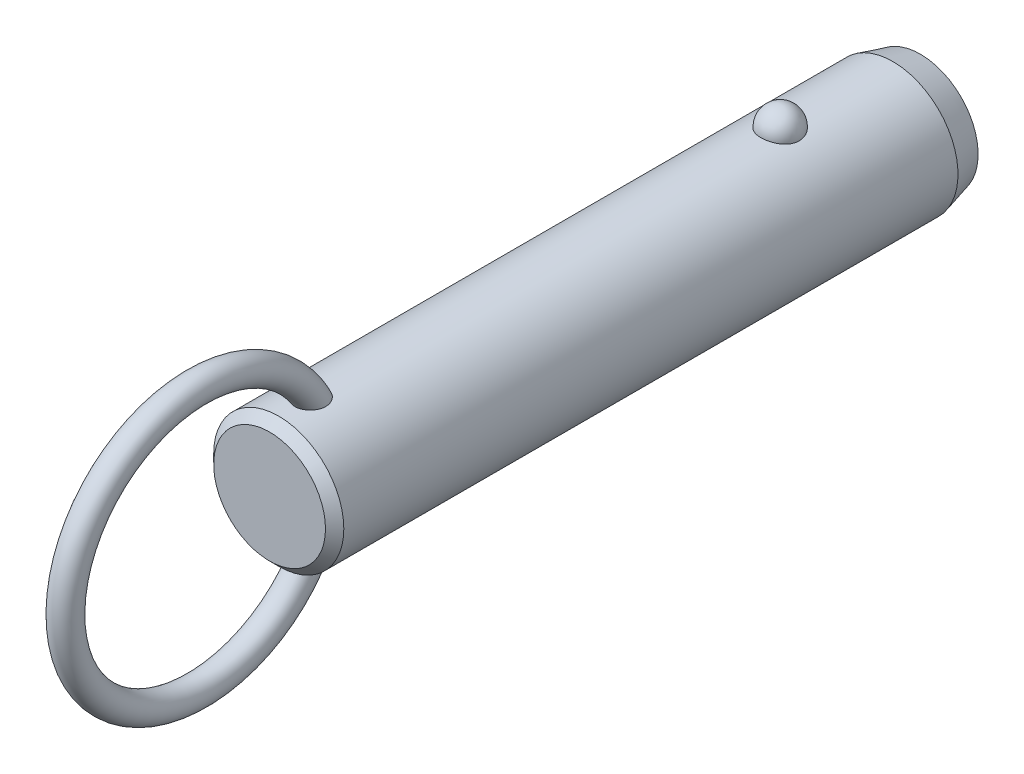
ISO-10303-21;
HEADER;
FILE_DESCRIPTION(('STEP AP214'),'2;1');
FILE_NAME('part.step','',(''),(''),'','','');
FILE_SCHEMA(('AUTOMOTIVE_DESIGN { 1 0 10303 214 1 1 1 1 }'));
ENDSEC;
DATA;
#1=APPLICATION_CONTEXT('core data for automotive mechanical design processes');
#2=APPLICATION_PROTOCOL_DEFINITION('international standard','automotive_design',2000,#1);
#3=PRODUCT_CONTEXT('',#1,'mechanical');
#4=PRODUCT('Part','Part','',(#3));
#5=PRODUCT_RELATED_PRODUCT_CATEGORY('part','',(#4));
#6=PRODUCT_DEFINITION_FORMATION('','',#4);
#7=PRODUCT_DEFINITION_CONTEXT('part definition',#1,'design');
#8=PRODUCT_DEFINITION('design','',#6,#7);
#9=PRODUCT_DEFINITION_SHAPE('','',#8);
#10=(LENGTH_UNIT() NAMED_UNIT(*) SI_UNIT(.MILLI.,.METRE.));
#11=(NAMED_UNIT(*) PLANE_ANGLE_UNIT() SI_UNIT($,.RADIAN.));
#12=(NAMED_UNIT(*) SI_UNIT($,.STERADIAN.) SOLID_ANGLE_UNIT());
#13=UNCERTAINTY_MEASURE_WITH_UNIT(LENGTH_MEASURE(1.E-05),#10,'distance_accuracy_value','');
#14=(GEOMETRIC_REPRESENTATION_CONTEXT(3) GLOBAL_UNCERTAINTY_ASSIGNED_CONTEXT((#13)) GLOBAL_UNIT_ASSIGNED_CONTEXT((#10,
#11,#12)) REPRESENTATION_CONTEXT('',''));
#15=CARTESIAN_POINT('',(0.,0.,0.));
#16=DIRECTION('',(0.,0.,1.));
#17=DIRECTION('',(1.,0.,0.));
#18=AXIS2_PLACEMENT_3D('',#15,#16,#17);
#19=CARTESIAN_POINT('',(0.,0.,45.7));
#20=DIRECTION('',(0.,0.,-1.));
#21=DIRECTION('',(-1.,0.,0.));
#22=AXIS2_PLACEMENT_3D('',#19,#20,#21);
#23=CYLINDRICAL_SURFACE('',#22,7.1);
#24=CARTESIAN_POINT('',(2.0769088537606,6.78943661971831,-2.1));
#25=CARTESIAN_POINT('',(2.07690739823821,6.78943796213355,-1.98268154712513));
#26=CARTESIAN_POINT('',(2.06738130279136,6.79237331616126,-1.86534506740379));
#27=CARTESIAN_POINT('',(2.0295040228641,6.8037853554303,-1.63400788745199));
#28=CARTESIAN_POINT('',(2.00114757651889,6.81226358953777,-1.52000812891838));
#29=CARTESIAN_POINT('',(1.92632025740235,6.83379798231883,-1.29863433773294));
#30=CARTESIAN_POINT('',(1.87985726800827,6.84685214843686,-1.19125744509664));
#31=CARTESIAN_POINT('',(1.76995205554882,6.87608091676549,-0.986046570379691));
#32=CARTESIAN_POINT('',(1.70650980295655,6.8922555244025,-0.888212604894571));
#33=CARTESIAN_POINT('',(1.56381192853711,6.92602930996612,-0.704242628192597));
#34=CARTESIAN_POINT('',(1.4844714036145,6.94363582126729,-0.618173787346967));
#35=CARTESIAN_POINT('',(1.31221746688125,6.97823658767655,-0.460740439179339));
#36=CARTESIAN_POINT('',(1.21930409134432,6.99523084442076,-0.389375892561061));
#37=CARTESIAN_POINT('',(1.02268781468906,7.02666176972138,-0.263547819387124));
#38=CARTESIAN_POINT('',(0.919020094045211,7.04110638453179,-0.209031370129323));
#39=CARTESIAN_POINT('',(0.703548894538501,7.06588726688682,-0.118163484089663));
#40=CARTESIAN_POINT('',(0.591746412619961,7.07622403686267,-0.081809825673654));
#41=CARTESIAN_POINT('',(0.365557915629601,7.09147068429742,-0.0288711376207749));
#42=CARTESIAN_POINT('',(0.251267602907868,7.09648447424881,-0.0119070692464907));
#43=CARTESIAN_POINT('',(0.0213499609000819,7.10089837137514,0.00304925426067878));
#44=CARTESIAN_POINT('',(-0.0942772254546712,7.10029907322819,0.00104351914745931));
#45=CARTESIAN_POINT('',(-0.321651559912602,7.09360829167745,-0.0216931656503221));
#46=CARTESIAN_POINT('',(-0.433431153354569,7.08760388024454,-0.0421272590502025));
#47=CARTESIAN_POINT('',(-0.651862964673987,7.07086131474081,-0.100729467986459));
#48=CARTESIAN_POINT('',(-0.758515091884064,7.06012307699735,-0.138897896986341));
#49=CARTESIAN_POINT('',(-0.96444924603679,7.03496097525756,-0.232213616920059));
#50=CARTESIAN_POINT('',(-1.06368095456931,7.02051445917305,-0.287465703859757));
#51=CARTESIAN_POINT('',(-1.25145353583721,6.98948740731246,-0.413383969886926));
#52=CARTESIAN_POINT('',(-1.33999321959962,6.97290663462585,-0.48405186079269));
#53=CARTESIAN_POINT('',(-1.50591604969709,6.93898770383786,-0.640594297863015));
#54=CARTESIAN_POINT('',(-1.58302488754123,6.92164094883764,-0.72675782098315));
#55=CARTESIAN_POINT('',(-1.72189320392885,6.8884103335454,-0.910927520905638));
#56=CARTESIAN_POINT('',(-1.78365144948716,6.87252659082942,-1.008934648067));
#57=CARTESIAN_POINT('',(-1.89101272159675,6.84377189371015,-1.21549497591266));
#58=CARTESIAN_POINT('',(-1.93639553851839,6.83094274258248,-1.32416860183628));
#59=CARTESIAN_POINT('',(-2.00874275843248,6.81002070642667,-1.54791500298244));
#60=CARTESIAN_POINT('',(-2.03570774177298,6.80192767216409,-1.66298757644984));
#61=CARTESIAN_POINT('',(-2.07047276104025,6.7914266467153,-1.89571453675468));
#62=CARTESIAN_POINT('',(-2.07835878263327,6.78899315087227,-2.01335491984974));
#63=CARTESIAN_POINT('',(-2.07502083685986,6.79001409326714,-2.24833570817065));
#64=CARTESIAN_POINT('',(-2.06379746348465,6.7934683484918,-2.36567612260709));
#65=CARTESIAN_POINT('',(-2.02263913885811,6.80583442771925,-2.59603194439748));
#66=CARTESIAN_POINT('',(-1.99281127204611,6.81471501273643,-2.70906820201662));
#67=CARTESIAN_POINT('',(-1.91526639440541,6.83691232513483,-2.92836575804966));
#68=CARTESIAN_POINT('',(-1.8675486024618,6.85022924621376,-3.03462676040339));
#69=CARTESIAN_POINT('',(-1.75504492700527,6.87991336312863,-3.23806487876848));
#70=CARTESIAN_POINT('',(-1.69015924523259,6.89629822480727,-3.33518422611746));
#71=CARTESIAN_POINT('',(-1.54505404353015,6.93024852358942,-3.51697105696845));
#72=CARTESIAN_POINT('',(-1.46483385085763,6.94781401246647,-3.60163799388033));
#73=CARTESIAN_POINT('',(-1.29071406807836,6.98225977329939,-3.75654119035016));
#74=CARTESIAN_POINT('',(-1.19675650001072,6.99913673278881,-3.82671308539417));
#75=CARTESIAN_POINT('',(-0.997940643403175,7.03023618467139,-3.9501837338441));
#76=CARTESIAN_POINT('',(-0.893083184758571,7.04445887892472,-4.00348377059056));
#77=CARTESIAN_POINT('',(-0.676902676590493,7.06848365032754,-4.09107242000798));
#78=CARTESIAN_POINT('',(-0.565686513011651,7.0783430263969,-4.12560889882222));
#79=CARTESIAN_POINT('',(-0.33873982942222,7.09282534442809,-4.17575450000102));
#80=CARTESIAN_POINT('',(-0.223009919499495,7.09744899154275,-4.19136617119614));
#81=CARTESIAN_POINT('',(0.00707628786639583,7.10090930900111,-4.20307965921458));
#82=CARTESIAN_POINT('',(0.121410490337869,7.09986531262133,-4.19958377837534));
#83=CARTESIAN_POINT('',(0.347815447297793,7.092380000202,-4.17411564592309));
#84=CARTESIAN_POINT('',(0.459886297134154,7.08593891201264,-4.15214417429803));
#85=CARTESIAN_POINT('',(0.678084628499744,7.06838983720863,-4.09049562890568));
#86=CARTESIAN_POINT('',(0.784237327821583,7.05730369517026,-4.05090137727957));
#87=CARTESIAN_POINT('',(0.988305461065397,7.03163139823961,-3.95511447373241));
#88=CARTESIAN_POINT('',(1.08622031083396,7.01704499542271,-3.89892064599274));
#89=CARTESIAN_POINT('',(1.27284490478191,6.98562668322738,-3.77035541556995));
#90=CARTESIAN_POINT('',(1.36137372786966,6.96876135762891,-3.69772964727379));
#91=CARTESIAN_POINT('',(1.52509486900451,6.93477412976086,-3.53878279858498));
#92=CARTESIAN_POINT('',(1.60028496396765,6.91765218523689,-3.45245943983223));
#93=CARTESIAN_POINT('',(1.73681688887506,6.88465753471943,-3.26658774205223));
#94=CARTESIAN_POINT('',(1.79785966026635,6.86881574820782,-3.16681408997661));
#95=CARTESIAN_POINT('',(1.90265327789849,6.84053157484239,-2.95814408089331));
#96=CARTESIAN_POINT('',(1.94640861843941,6.82808830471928,-2.84925010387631));
#97=CARTESIAN_POINT('',(2.01274378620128,6.80881460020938,-2.63454318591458));
#98=CARTESIAN_POINT('',(2.03676193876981,6.80160856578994,-2.52920574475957));
#99=CARTESIAN_POINT('',(2.06884490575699,6.79191902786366,-2.3159172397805));
#100=CARTESIAN_POINT('',(2.07691019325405,6.78943538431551,-2.20796625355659));
#101=CARTESIAN_POINT('',(2.0769088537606,6.78943661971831,-2.1));
#102=B_SPLINE_CURVE_WITH_KNOTS('',3,(#24,#25,#26,#27,#28,#29,#30,#31,#32,#33,#34,#35,#36,#37,
#38,#39,#40,#41,#42,#43,#44,#45,#46,#47,#48,#49,#50,#51,#52,#53,#54,#55,#56,#57,#58,#59,#60,#61,
#62,#63,#64,#65,#66,#67,#68,#69,#70,#71,#72,#73,#74,#75,#76,#77,#78,#79,#80,#81,#82,#83,#84,#85,
#86,#87,#88,#89,#90,#91,#92,#93,#94,#95,#96,#97,#98,#99,#100,#101),.UNSPECIFIED.,.T.,.F.,(4,2,2,
2,2,2,2,2,2,2,2,2,2,2,2,2,2,2,2,2,2,2,2,2,2,2,2,2,2,2,2,2,2,2,2,2,2,2,4),(0.,0.351568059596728,
0.703234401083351,1.05474780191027,1.40626181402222,1.75970563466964,2.11314851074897,
2.4654696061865,2.81774759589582,3.16301449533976,3.50824481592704,3.84801136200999,
4.18778391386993,4.52968352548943,4.87162112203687,5.22076181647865,5.56993054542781,
5.92363364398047,6.27732559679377,6.62942052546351,6.98150450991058,7.33158042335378,
7.68167162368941,8.03384443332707,8.38603269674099,8.73975272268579,9.09344583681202,
9.44234545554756,9.79119807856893,10.1327344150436,10.4742563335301,10.8141898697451,
11.1541474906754,11.4997793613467,11.8454687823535,12.1979079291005,12.5502553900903,
12.8738073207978,13.1973496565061),.UNSPECIFIED.);
#103=CARTESIAN_POINT('',(2.0769088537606,6.78943661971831,-2.1));
#104=VERTEX_POINT('',#103);
#105=EDGE_CURVE('E41',#104,#104,#102,.T.);
#106=ORIENTED_EDGE('',*,*,#105,.T.);
#107=EDGE_LOOP('',(#106));
#108=FACE_BOUND('',#107,.T.);
#109=CARTESIAN_POINT('',(0.,0.,52.62));
#110=DIRECTION('',(0.,0.,1.));
#111=DIRECTION('',(1.,0.,0.));
#112=AXIS2_PLACEMENT_3D('',#109,#110,#111);
#113=CIRCLE('',#112,7.1);
#114=CARTESIAN_POINT('',(7.1,0.,52.62));
#115=VERTEX_POINT('',#114);
#116=EDGE_CURVE('E10',#115,#115,#113,.F.);
#117=ORIENTED_EDGE('',*,*,#116,.T.);
#118=EDGE_LOOP('',(#117));
#119=FACE_BOUND('',#118,.T.);
#120=CARTESIAN_POINT('',(-0.429539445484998,-7.08699541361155,47.4429212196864));
#121=CARTESIAN_POINT('',(-0.50833166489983,-7.08221999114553,47.4668764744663));
#122=CARTESIAN_POINT('',(-0.585039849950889,-7.07624016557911,47.4974570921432));
#123=CARTESIAN_POINT('',(-0.732082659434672,-7.06254296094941,47.5710242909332));
#124=CARTESIAN_POINT('',(-0.802417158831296,-7.05482554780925,47.6140111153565));
#125=CARTESIAN_POINT('',(-0.934722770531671,-7.03851844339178,47.7111135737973));
#126=CARTESIAN_POINT('',(-0.996700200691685,-7.02992941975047,47.7652207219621));
#127=CARTESIAN_POINT('',(-1.11079942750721,-7.01280697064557,47.8829676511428));
#128=CARTESIAN_POINT('',(-1.16292136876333,-7.00427354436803,47.9466072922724));
#129=CARTESIAN_POINT('',(-1.25705660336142,-6.98799959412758,48.0826870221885));
#130=CARTESIAN_POINT('',(-1.29888032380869,-6.98027525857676,48.1552598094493));
#131=CARTESIAN_POINT('',(-1.37069920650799,-6.96652886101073,48.3061686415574));
#132=CARTESIAN_POINT('',(-1.40069157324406,-6.96050720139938,48.3845060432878));
#133=CARTESIAN_POINT('',(-1.45043507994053,-6.95031881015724,48.5501903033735));
#134=CARTESIAN_POINT('',(-1.46937115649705,-6.94630231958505,48.6377897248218));
#135=CARTESIAN_POINT('',(-1.49424917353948,-6.94099239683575,48.8148714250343));
#136=CARTESIAN_POINT('',(-1.50018601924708,-6.93970003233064,48.9043544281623));
#137=CARTESIAN_POINT('',(-1.49978214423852,-6.93978815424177,49.0940607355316));
#138=CARTESIAN_POINT('',(-1.49187639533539,-6.94150934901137,49.194279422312));
#139=CARTESIAN_POINT('',(-1.46177925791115,-6.94790814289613,49.3924798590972));
#140=CARTESIAN_POINT('',(-1.43957541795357,-6.95258831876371,49.490459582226));
#141=CARTESIAN_POINT('',(-1.37783293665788,-6.96510647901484,49.6953629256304));
#142=CARTESIAN_POINT('',(-1.33634073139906,-6.97328848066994,49.8016801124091));
#143=CARTESIAN_POINT('',(-1.23686994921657,-6.99161706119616,50.0061777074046));
#144=CARTESIAN_POINT('',(-1.17889192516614,-7.00176357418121,50.1043583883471));
#145=CARTESIAN_POINT('',(-1.0587512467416,-7.02082898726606,50.2723743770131));
#146=CARTESIAN_POINT('',(-0.999247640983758,-7.02963746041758,50.3441230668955));
#147=CARTESIAN_POINT('',(-0.86949477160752,-7.04686074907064,50.4771959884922));
#148=CARTESIAN_POINT('',(-0.799263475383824,-7.05527619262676,50.5385372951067));
#149=CARTESIAN_POINT('',(-0.665408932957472,-7.06899457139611,50.6351316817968));
#150=CARTESIAN_POINT('',(-0.603817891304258,-7.07457275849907,50.6731512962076));
#151=CARTESIAN_POINT('',(-0.475172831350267,-7.08437420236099,50.7387581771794));
#152=CARTESIAN_POINT('',(-0.40812301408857,-7.08859848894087,50.7663533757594));
#153=CARTESIAN_POINT('',(-0.269431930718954,-7.09522749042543,50.8092569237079));
#154=CARTESIAN_POINT('',(-0.197757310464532,-7.09761688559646,50.8244618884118));
#155=CARTESIAN_POINT('',(-0.0527849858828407,-7.10017268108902,50.8407168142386));
#156=CARTESIAN_POINT('',(0.020511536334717,-7.10034065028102,50.8417767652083));
#157=CARTESIAN_POINT('',(0.156426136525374,-7.09855986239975,50.8304619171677));
#158=CARTESIAN_POINT('',(0.219199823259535,-7.09688191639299,50.8198060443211));
#159=CARTESIAN_POINT('',(0.342134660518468,-7.09201880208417,50.7885379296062));
#160=CARTESIAN_POINT('',(0.402295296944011,-7.08883333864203,50.7679237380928));
#161=CARTESIAN_POINT('',(0.520687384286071,-7.08113868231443,50.7172125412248));
#162=CARTESIAN_POINT('',(0.578791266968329,-7.07658958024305,50.6868272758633));
#163=CARTESIAN_POINT('',(0.690173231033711,-7.06659708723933,50.6183678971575));
#164=CARTESIAN_POINT('',(0.743447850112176,-7.061153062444,50.5802883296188));
#165=CARTESIAN_POINT('',(0.870947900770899,-7.04680292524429,50.4765929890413));
#166=CARTESIAN_POINT('',(0.941828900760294,-7.0375580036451,50.4068972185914));
#167=CARTESIAN_POINT('',(1.07136606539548,-7.01900793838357,50.2569450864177));
#168=CARTESIAN_POINT('',(1.13000013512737,-7.00970271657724,50.1766700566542));
#169=CARTESIAN_POINT('',(1.23579584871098,-6.99183327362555,50.0068997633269));
#170=CARTESIAN_POINT('',(1.2827427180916,-6.98328455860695,49.9172696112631));
#171=CARTESIAN_POINT('',(1.36351442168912,-6.96796352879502,49.7321763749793));
#172=CARTESIAN_POINT('',(1.39733971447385,-6.96119115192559,49.6367134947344));
#173=CARTESIAN_POINT('',(1.45579181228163,-6.94922464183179,49.4253092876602));
#174=CARTESIAN_POINT('',(1.47790145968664,-6.94449000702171,49.308631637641));
#175=CARTESIAN_POINT('',(1.50168752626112,-6.93938731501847,49.0730153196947));
#176=CARTESIAN_POINT('',(1.50336085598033,-6.93901991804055,48.9540763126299));
#177=CARTESIAN_POINT('',(1.48486516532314,-6.9430010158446,48.7236079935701));
#178=CARTESIAN_POINT('',(1.46573441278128,-6.9471253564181,48.6119958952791));
#179=CARTESIAN_POINT('',(1.40606892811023,-6.95944667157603,48.3948868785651));
#180=CARTESIAN_POINT('',(1.36556446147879,-6.96763788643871,48.2893815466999));
#181=CARTESIAN_POINT('',(1.27082700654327,-6.98548038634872,48.1042879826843));
#182=CARTESIAN_POINT('',(1.21949810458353,-6.99473841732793,48.0231719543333));
#183=CARTESIAN_POINT('',(1.10242050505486,-7.01414069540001,47.8722278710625));
#184=CARTESIAN_POINT('',(1.03668119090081,-7.02428436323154,47.8023925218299));
#185=CARTESIAN_POINT('',(0.900559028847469,-7.04295285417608,47.6835735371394));
#186=CARTESIAN_POINT('',(0.831428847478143,-7.05153466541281,47.6331573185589));
#187=CARTESIAN_POINT('',(0.685291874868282,-7.06723150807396,47.5451429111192));
#188=CARTESIAN_POINT('',(0.60828720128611,-7.0743469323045,47.5075412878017));
#189=CARTESIAN_POINT('',(0.451878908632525,-7.08602232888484,47.4474915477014));
#190=CARTESIAN_POINT('',(0.372686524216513,-7.09067127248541,47.4245088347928));
#191=CARTESIAN_POINT('',(0.211477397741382,-7.09730788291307,47.3920357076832));
#192=CARTESIAN_POINT('',(0.129460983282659,-7.09929585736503,47.3825437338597));
#193=CARTESIAN_POINT('',(-0.0332905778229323,-7.10037858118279,47.3773517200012));
#194=CARTESIAN_POINT('',(-0.114016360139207,-7.09953334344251,47.3813656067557));
#195=CARTESIAN_POINT('',(-0.273670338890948,-7.09517338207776,47.4024540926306));
#196=CARTESIAN_POINT('',(-0.352598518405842,-7.09165863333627,47.4195288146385));
#197=CARTESIAN_POINT('',(-0.429539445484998,-7.08699541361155,47.4429212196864));
#198=B_SPLINE_CURVE_WITH_KNOTS('',3,(#120,#121,#122,#123,#124,#125,#126,#127,#128,#129,#130,
#131,#132,#133,#134,#135,#136,#137,#138,#139,#140,#141,#142,#143,#144,#145,#146,#147,#148,#149,
#150,#151,#152,#153,#154,#155,#156,#157,#158,#159,#160,#161,#162,#163,#164,#165,#166,#167,#168,
#169,#170,#171,#172,#173,#174,#175,#176,#177,#178,#179,#180,#181,#182,#183,#184,#185,#186,#187,
#188,#189,#190,#191,#192,#193,#194,#195,#196,#197),.UNSPECIFIED.,.T.,.F.,(4,2,2,2,2,2,2,2,2,2,2,
2,2,2,2,2,2,2,2,2,2,2,2,2,2,2,2,2,2,2,2,2,2,2,2,2,2,2,4),(0.,0.247183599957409,
0.494372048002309,0.741372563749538,0.98836945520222,1.23962059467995,1.49093106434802,
1.75897818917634,2.02713035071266,2.32758265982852,2.62829697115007,2.9700873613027,
3.31186629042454,3.5917531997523,3.87117637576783,4.08813841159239,4.30493502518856,
4.52352259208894,4.74195577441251,4.93215328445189,5.12238804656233,5.31884850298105,
5.51544871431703,5.8133231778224,6.11173048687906,6.41527266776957,6.71880423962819,
7.07358156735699,7.42841252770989,7.76631485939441,8.10373999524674,8.39142246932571,
8.67891817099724,8.93560332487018,9.19221962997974,9.43881106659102,9.68537399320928,
9.92674752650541,10.1681233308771),.UNSPECIFIED.);
#199=CARTESIAN_POINT('',(-0.429539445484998,-7.08699541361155,47.4429212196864));
#200=VERTEX_POINT('',#199);
#201=EDGE_CURVE('E60',#200,#200,#198,.T.);
#202=ORIENTED_EDGE('',*,*,#201,.T.);
#203=EDGE_LOOP('',(#202));
#204=FACE_BOUND('',#203,.T.);
#205=CARTESIAN_POINT('',(-0.429539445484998,7.08699541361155,47.4429212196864));
#206=CARTESIAN_POINT('',(-0.351665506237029,7.09171429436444,47.4192469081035));
#207=CARTESIAN_POINT('',(-0.271733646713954,7.09525896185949,47.4020369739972));
#208=CARTESIAN_POINT('',(-0.110026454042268,7.09960839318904,47.3810059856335));
#209=CARTESIAN_POINT('',(-0.0282502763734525,7.10041187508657,47.377191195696));
#210=CARTESIAN_POINT('',(0.134782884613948,7.09918849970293,47.383059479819));
#211=CARTESIAN_POINT('',(0.216039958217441,7.09716214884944,47.3927401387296));
#212=CARTESIAN_POINT('',(0.375730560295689,7.09050177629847,47.4253471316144));
#213=CARTESIAN_POINT('',(0.454164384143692,7.08586802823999,47.4482720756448));
#214=CARTESIAN_POINT('',(0.606025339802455,7.07449911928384,47.506771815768));
#215=CARTESIAN_POINT('',(0.679451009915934,7.06776334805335,47.5423502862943));
#216=CARTESIAN_POINT('',(0.819234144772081,7.05292866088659,47.6251753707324));
#217=CARTESIAN_POINT('',(0.885591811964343,7.04482978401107,47.6724216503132));
#218=CARTESIAN_POINT('',(1.00993211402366,7.02808709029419,47.7775902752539));
#219=CARTESIAN_POINT('',(1.06785399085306,7.01943990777,47.835583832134));
#220=CARTESIAN_POINT('',(1.17342527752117,7.00256662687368,47.9603013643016));
#221=CARTESIAN_POINT('',(1.22107408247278,6.99434055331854,48.0270258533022));
#222=CARTESIAN_POINT('',(1.30652927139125,6.97889183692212,48.1693622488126));
#223=CARTESIAN_POINT('',(1.34399711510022,6.97170674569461,48.2451808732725));
#224=CARTESIAN_POINT('',(1.40682616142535,6.95930080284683,48.4018100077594));
#225=CARTESIAN_POINT('',(1.43218374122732,6.95408053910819,48.4826220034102));
#226=CARTESIAN_POINT('',(1.47246409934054,6.94566853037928,48.6535314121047));
#227=CARTESIAN_POINT('',(1.48642590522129,6.9426653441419,48.7438630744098));
#228=CARTESIAN_POINT('',(1.5011410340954,6.93949744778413,48.925619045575));
#229=CARTESIAN_POINT('',(1.50188917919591,6.93933385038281,49.0170437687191));
#230=CARTESIAN_POINT('',(1.49030464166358,6.94183245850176,49.2108438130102));
#231=CARTESIAN_POINT('',(1.47627413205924,6.94486147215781,49.313112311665));
#232=CARTESIAN_POINT('',(1.43356351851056,6.95380194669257,49.5144719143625));
#233=CARTESIAN_POINT('',(1.4048676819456,6.95971650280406,49.6135594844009));
#234=CARTESIAN_POINT('',(1.32908750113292,6.97461208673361,49.8189087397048));
#235=CARTESIAN_POINT('',(1.28011435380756,6.98388945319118,49.9244566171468));
#236=CARTESIAN_POINT('',(1.16520357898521,7.00397743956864,50.1257604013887));
#237=CARTESIAN_POINT('',(1.09927694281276,7.01478706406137,50.2215225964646));
#238=CARTESIAN_POINT('',(0.969361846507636,7.03373936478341,50.3767565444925));
#239=CARTESIAN_POINT('',(0.909042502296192,7.04187023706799,50.4393032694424));
#240=CARTESIAN_POINT('',(0.779178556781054,7.05741732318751,50.5540535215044));
#241=CARTESIAN_POINT('',(0.709649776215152,7.06483472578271,50.6062744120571));
#242=CARTESIAN_POINT('',(0.576854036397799,7.0767751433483,50.6881138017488));
#243=CARTESIAN_POINT('',(0.515118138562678,7.08158033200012,50.7201641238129));
#244=CARTESIAN_POINT('',(0.387127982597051,7.08972701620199,50.7737656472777));
#245=CARTESIAN_POINT('',(0.320877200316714,7.09306962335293,50.7953248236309));
#246=CARTESIAN_POINT('',(0.185041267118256,7.09791507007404,50.8264005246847));
#247=CARTESIAN_POINT('',(0.115437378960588,7.09940591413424,50.8358385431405));
#248=CARTESIAN_POINT('',(-0.0243157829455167,7.10030171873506,50.8415226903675));
#249=CARTESIAN_POINT('',(-0.094464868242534,7.0997073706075,50.8377731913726));
#250=CARTESIAN_POINT('',(-0.225713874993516,7.09668414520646,50.8185081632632));
#251=CARTESIAN_POINT('',(-0.287006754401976,7.09444865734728,50.8042323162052));
#252=CARTESIAN_POINT('',(-0.406555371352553,7.08860360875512,50.7663685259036));
#253=CARTESIAN_POINT('',(-0.464809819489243,7.08499346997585,50.7427766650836));
#254=CARTESIAN_POINT('',(-0.594955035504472,7.07541654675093,50.6789232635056));
#255=CARTESIAN_POINT('',(-0.665389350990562,7.06906574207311,50.635753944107));
#256=CARTESIAN_POINT('',(-0.798242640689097,7.05530261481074,50.538587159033));
#257=CARTESIAN_POINT('',(-0.860645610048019,7.0478882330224,50.4845686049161));
#258=CARTESIAN_POINT('',(-0.994249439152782,7.03045217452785,50.3509965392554));
#259=CARTESIAN_POINT('',(-1.06260129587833,7.02030745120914,50.2686143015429));
#260=CARTESIAN_POINT('',(-1.18502045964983,7.00068382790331,50.093843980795));
#261=CARTESIAN_POINT('',(-1.239076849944,6.99120544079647,50.001448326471));
#262=CARTESIAN_POINT('',(-1.33335589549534,6.97384343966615,49.8080085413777));
#263=CARTESIAN_POINT('',(-1.3733613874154,6.96598557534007,49.7068564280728));
#264=CARTESIAN_POINT('',(-1.43770677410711,6.9529905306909,49.4995046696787));
#265=CARTESIAN_POINT('',(-1.46204473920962,6.94785368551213,49.39330440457));
#266=CARTESIAN_POINT('',(-1.49537533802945,6.94076296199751,49.168231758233));
#267=CARTESIAN_POINT('',(-1.50273564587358,6.93914842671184,49.0490975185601));
#268=CARTESIAN_POINT('',(-1.4954555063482,6.94072368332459,48.8114703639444));
#269=CARTESIAN_POINT('',(-1.48082914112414,6.94391040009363,48.6929770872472));
#270=CARTESIAN_POINT('',(-1.43076401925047,6.95438579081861,48.4734325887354));
#271=CARTESIAN_POINT('',(-1.39762227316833,6.96121852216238,48.3718413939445));
#272=CARTESIAN_POINT('',(-1.31211274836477,6.97783941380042,48.1773513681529));
#273=CARTESIAN_POINT('',(-1.25976607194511,6.98762432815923,48.08444313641));
#274=CARTESIAN_POINT('',(-1.14583073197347,7.00713153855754,47.9241601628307));
#275=CARTESIAN_POINT('',(-1.08665947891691,7.01665982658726,47.8550351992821));
#276=CARTESIAN_POINT('',(-0.956606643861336,7.03556646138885,47.7288786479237));
#277=CARTESIAN_POINT('',(-0.885737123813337,7.04494495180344,47.6718347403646));
#278=CARTESIAN_POINT('',(-0.751558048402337,7.06035735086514,47.5831004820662));
#279=CARTESIAN_POINT('',(-0.690120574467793,7.0666695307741,47.5485932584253));
#280=CARTESIAN_POINT('',(-0.562815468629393,7.07794609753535,47.4887507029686));
#281=CARTESIAN_POINT('',(-0.496948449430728,7.08291067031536,47.4634141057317));
#282=CARTESIAN_POINT('',(-0.429539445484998,7.08699541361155,47.4429212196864));
#283=B_SPLINE_CURVE_WITH_KNOTS('',3,(#205,#206,#207,#208,#209,#210,#211,#212,#213,#214,#215,
#216,#217,#218,#219,#220,#221,#222,#223,#224,#225,#226,#227,#228,#229,#230,#231,#232,#233,#234,
#235,#236,#237,#238,#239,#240,#241,#242,#243,#244,#245,#246,#247,#248,#249,#250,#251,#252,#253,
#254,#255,#256,#257,#258,#259,#260,#261,#262,#263,#264,#265,#266,#267,#268,#269,#270,#271,#272,
#273,#274,#275,#276,#277,#278,#279,#280,#281,#282),.UNSPECIFIED.,.T.,.F.,(4,2,2,2,2,2,2,2,2,2,2,
2,2,2,2,2,2,2,2,2,2,2,2,2,2,2,2,2,2,2,2,2,2,2,2,2,2,2,4),(0.,0.244335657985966,
0.488785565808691,0.733191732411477,0.977572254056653,1.22202379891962,1.46646834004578,
1.71259457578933,1.9587352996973,2.21226768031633,2.46587585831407,2.73913816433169,
3.01250754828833,3.32109936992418,3.63002293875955,3.97863512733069,4.32702187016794,
4.58793945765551,4.84841449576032,5.05676704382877,5.26496096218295,5.47449661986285,
5.68396281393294,5.87205447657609,6.06022532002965,6.30743751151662,6.55513496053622,
6.87602468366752,7.19715875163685,7.52305774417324,7.84899686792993,8.20516155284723,
8.5610982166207,8.88040084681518,9.19935367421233,9.47236282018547,9.74509220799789,
9.95662250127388,10.1681235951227),.UNSPECIFIED.);
#284=CARTESIAN_POINT('',(-0.429539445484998,7.08699541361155,47.4429212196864));
#285=VERTEX_POINT('',#284);
#286=EDGE_CURVE('E68',#285,#285,#283,.T.);
#287=ORIENTED_EDGE('',*,*,#286,.T.);
#288=EDGE_LOOP('',(#287));
#289=FACE_BOUND('',#288,.T.);
#290=CARTESIAN_POINT('',(0.,0.,-14.4000000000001));
#291=DIRECTION('',(0.,0.,-1.));
#292=DIRECTION('',(-1.,0.,0.));
#293=AXIS2_PLACEMENT_3D('',#290,#291,#292);
#294=CIRCLE('',#293,7.1);
#295=CARTESIAN_POINT('',(-7.1,0.,-14.4000000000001));
#296=VERTEX_POINT('',#295);
#297=EDGE_CURVE('E57',#296,#296,#294,.F.);
#298=ORIENTED_EDGE('',*,*,#297,.T.);
#299=EDGE_LOOP('',(#298));
#300=FACE_BOUND('',#299,.T.);
#301=ADVANCED_FACE('F37',(#108,#119,#204,#289,#300),#23,.T.);
#302=CARTESIAN_POINT('',(0.,0.,-17.4));
#303=DIRECTION('',(0.,0.,-1.));
#304=DIRECTION('',(-1.,0.,0.));
#305=AXIS2_PLACEMENT_3D('',#302,#303,#304);
#306=PLANE('',#305);
#307=CARTESIAN_POINT('',(0.,0.,-17.4));
#308=DIRECTION('',(0.,0.,-1.));
#309=DIRECTION('',(-1.,0.,0.));
#310=AXIS2_PLACEMENT_3D('',#307,#308,#309);
#311=CIRCLE('',#310,6.29615242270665);
#312=CARTESIAN_POINT('',(-6.29615242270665,0.,-17.4));
#313=VERTEX_POINT('',#312);
#314=EDGE_CURVE('E67',#313,#313,#311,.T.);
#315=ORIENTED_EDGE('',*,*,#314,.T.);
#316=EDGE_LOOP('',(#315));
#317=FACE_BOUND('',#316,.T.);
#318=ADVANCED_FACE('F86',(#317),#306,.T.);
#319=CARTESIAN_POINT('',(0.,0.,-17.4));
#320=DIRECTION('',(0.,0.,1.));
#321=DIRECTION('',(1.,0.,0.));
#322=AXIS2_PLACEMENT_3D('',#319,#320,#321);
#323=CONICAL_SURFACE('',#322,6.29615242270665,0.26179938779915);
#324=ORIENTED_EDGE('',*,*,#297,.F.);
#325=EDGE_LOOP('',(#324));
#326=FACE_BOUND('',#325,.T.);
#327=ORIENTED_EDGE('',*,*,#314,.F.);
#328=EDGE_LOOP('',(#327));
#329=FACE_BOUND('',#328,.T.);
#330=ADVANCED_FACE('F84',(#326,#329),#323,.T.);
#331=CARTESIAN_POINT('',(0.,0.,53.62));
#332=DIRECTION('',(0.,0.,1.));
#333=DIRECTION('',(1.,0.,0.));
#334=AXIS2_PLACEMENT_3D('',#331,#332,#333);
#335=PLANE('',#334);
#336=CARTESIAN_POINT('',(0.,0.,53.62));
#337=DIRECTION('',(0.,0.,1.));
#338=DIRECTION('',(1.,0.,0.));
#339=AXIS2_PLACEMENT_3D('',#336,#337,#338);
#340=CIRCLE('',#339,6.10000000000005);
#341=CARTESIAN_POINT('',(6.10000000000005,0.,53.62));
#342=VERTEX_POINT('',#341);
#343=EDGE_CURVE('E50',#342,#342,#340,.T.);
#344=ORIENTED_EDGE('',*,*,#343,.T.);
#345=EDGE_LOOP('',(#344));
#346=FACE_BOUND('',#345,.T.);
#347=ADVANCED_FACE('F78',(#346),#335,.T.);
#348=CARTESIAN_POINT('',(0.,0.,61.55));
#349=DIRECTION('',(1.,0.,0.));
#350=DIRECTION('',(0.,0.,-1.));
#351=AXIS2_PLACEMENT_3D('',#348,#349,#350);
#352=TOROIDAL_SURFACE('',#351,14.35,1.5);
#353=ORIENTED_EDGE('',*,*,#286,.F.);
#354=EDGE_LOOP('',(#353));
#355=FACE_BOUND('',#354,.T.);
#356=ORIENTED_EDGE('',*,*,#201,.F.);
#357=EDGE_LOOP('',(#356));
#358=FACE_BOUND('',#357,.T.);
#359=ADVANCED_FACE('F74',(#355,#358),#352,.T.);
#360=CARTESIAN_POINT('',(0.,0.,53.62));
#361=DIRECTION('',(0.,0.,-1.));
#362=DIRECTION('',(-1.,0.,0.));
#363=AXIS2_PLACEMENT_3D('',#360,#361,#362);
#364=CONICAL_SURFACE('',#363,6.10000000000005,0.785398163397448);
#365=ORIENTED_EDGE('',*,*,#116,.F.);
#366=EDGE_LOOP('',(#365));
#367=FACE_BOUND('',#366,.T.);
#368=ORIENTED_EDGE('',*,*,#343,.F.);
#369=EDGE_LOOP('',(#368));
#370=FACE_BOUND('',#369,.T.);
#371=ADVANCED_FACE('F39',(#367,#370),#364,.T.);
#372=CARTESIAN_POINT('',(0.,7.1,-2.1));
#373=DIRECTION('',(0.,1.,0.));
#374=DIRECTION('',(0.,0.,1.));
#375=AXIS2_PLACEMENT_3D('',#372,#373,#374);
#376=SPHERICAL_SURFACE('',#375,2.10000000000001);
#377=ORIENTED_EDGE('',*,*,#105,.F.);
#378=EDGE_LOOP('',(#377));
#379=FACE_BOUND('',#378,.T.);
#380=ADVANCED_FACE('F80',(#379),#376,.T.);
#381=CLOSED_SHELL('',(#301,#318,#330,#347,#359,#371,#380));
#382=MANIFOLD_SOLID_BREP('B2',#381);
#383=ADVANCED_BREP_SHAPE_REPRESENTATION('',(#18,#382),#14);
#384=SHAPE_DEFINITION_REPRESENTATION(#9,#383);
ENDSEC;
END-ISO-10303-21;
